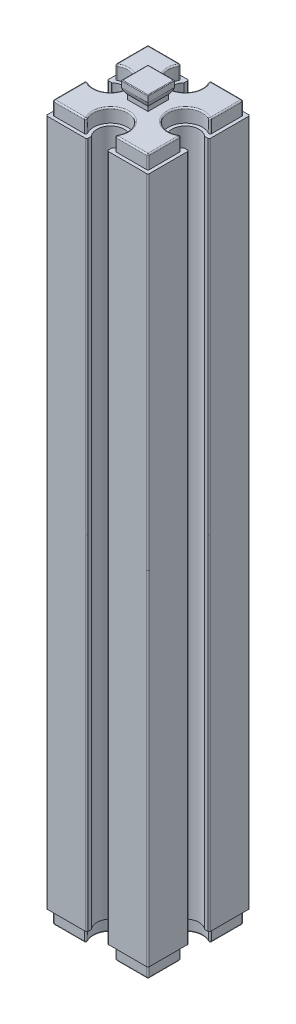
from build123d import *

# Parameters (mm, degrees)
EXTRUDE_1_DEPTH        = 50.5
EXTRUDE_2_DEPTH        = 2
EXTRUDE_3_DEPTH        = 2
FILLET_3_R             = 0.2
CUT_EXTRUDE_1_DEPTH    = 3
FILLET_4_R             = 0.2
FILLET_5_R             = 0.1
FILLET_3_OF_MIRROR_1_R = 0.2
FILLET_4_OF_MIRROR_1_R = 0.2
FILLET_5_OF_MIRROR_1_R = 0.1


with BuildPart() as part:
    # Sketch 1 → Extrude 1 (new body)
    with BuildSketch(Plane(origin=(0, 0, 0), x_dir=(1, 0, 0), z_dir=(0, 1, 0))):
        with BuildLine():
            Line((-7.5, 7.5), (-1.5, 7.5))
            Line((-1.5, 7.5), (-1.5, 6.822875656))
            ThreePointArc((-1.5, 6.822875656), (0, 3.5), (1.5, 6.822875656))
            Line((1.5, 6.822875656), (1.5, 7.5))
            Line((1.5, 7.5), (7.5, 7.5))
            Line((7.5, 7.5), (7.5, 1.5))
            Line((7.5, 1.5), (6.822875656, 1.5))
            ThreePointArc((6.822875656, 1.5), (3.5, 0), (6.822875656, -1.5))
            Line((6.822875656, -1.5), (7.5, -1.5))
            Line((7.5, -1.5), (7.5, -7.5))
            Line((7.5, -7.5), (1.5, -7.5))
            Line((1.5, -7.5), (1.5, -6.822875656))
            ThreePointArc((1.5, -6.822875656), (0, -3.5), (-1.5, -6.822875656))
            Line((-1.5, -6.822875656), (-1.5, -7.5))
            Line((-1.5, -7.5), (-7.5, -7.5))
            Line((-7.5, -7.5), (-7.5, -1.5))
            Line((-7.5, -1.5), (-6.822875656, -1.5))
            ThreePointArc((-6.822875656, -1.5), (-3.5, 0), (-6.822875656, 1.5))
            Line((-6.822875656, 1.5), (-7.5, 1.5))
            Line((-7.5, 1.5), (-7.5, 7.5))
        make_face()
    extrude_1 = extrude(amount=EXTRUDE_1_DEPTH)

    # Sketch 2 → Extrude 2 (add)
    with BuildSketch(Plane(origin=(0, 50.5, 0), x_dir=(1, 0, 0), z_dir=(0, 1, 0))):
        with BuildLine():
            Line((-7, 7), (-7, 2))
            ThreePointArc((-7, 2), (-3, 0), (-7, -2))
            Line((-7, -2), (-7, -7))
            Line((-7, -7), (-2, -7))
            ThreePointArc((-2, -7), (0, -3), (2, -7))
            Line((2, -7), (7, -7))
            Line((7, -7), (7, -2))
            ThreePointArc((7, -2), (3, 0), (7, 2))
            Line((7, 2), (7, 7))
            Line((7, 7), (2, 7))
            ThreePointArc((2, 7), (0, 3), (-2, 7))
            Line((-2, 7), (-7, 7))
        make_face()
    extrude_2 = extrude(amount=EXTRUDE_2_DEPTH)

    # Sketch 3 → Extrude 3 (add, symmetric)
    with BuildSketch(Plane(origin=(0, 0, 0), x_dir=(0, 0, -1), z_dir=(1, 0, 0))):
        with BuildLine():
            Line((-1.5, 52.5), (1.5, 52.5))
            Line((1.5, 52.5), (1.5, 53.177124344))
            ThreePointArc((1.5, 53.177124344), (1.780042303, 53.588161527), (1.95, 54.055590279))
            Line((1.95, 54.055590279), (1.95, 55))
            Line((1.95, 55), (-1.95, 55))
            Line((-1.95, 55), (-1.95, 54.055590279))
            ThreePointArc((-1.95, 54.055590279), (-1.780042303, 53.588161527), (-1.5, 53.177124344))
            Line((-1.5, 53.177124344), (-1.5, 52.5))
        make_face()
    extrude_3 = extrude(amount=EXTRUDE_3_DEPTH, both=True)

    # Fillet 3
    fillet_3_edges = [part.edges().sort_by_distance(p)[0] for p in [
        (-7.5, 25.25, -7.5),
        (-1.5, 25.25, -7.5),
        (1.5, 25.25, -7.5),
        (7.5, 25.25, -7.5),
        (7.5, 25.25, -1.5),
        (7.5, 25.25, 1.5),
        (7.5, 25.25, 7.5),
        (1.5, 25.25, 7.5),
        (-1.5, 25.25, 7.5),
        (-7.5, 25.25, 7.5),
        (-7.5, 25.25, 1.5),
        (-6.822875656, 25.25, -1.5),
        (-7.5, 25.25, -1.5),
    ]]
    fillet(fillet_3_edges, radius=FILLET_3_R)

    # Sketch 4 → Cut-Extrude 1 (cut, symmetric)
    with BuildSketch(Plane.XY):
        with BuildLine():
            Line((1.95, 55), (2, 55))
            Line((2, 55), (2, 52.5))
            Line((2, 52.5), (1.5, 52.5))
            Line((1.5, 52.5), (1.5, 53.177124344))
            ThreePointArc((1.5, 53.177124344), (1.780042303, 53.588161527), (1.95, 54.055590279))
            Line((1.95, 54.055590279), (1.95, 55))
        make_face()
        with BuildLine():
            Line((-1.95, 55), (-1.95, 54.055590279))
            ThreePointArc((-1.95, 54.055590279), (-1.780042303, 53.588161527), (-1.5, 53.177124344))
            Line((-1.5, 53.177124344), (-1.5, 52.5))
            Line((-1.5, 52.5), (-2, 52.5))
            Line((-2, 52.5), (-2, 55))
            Line((-2, 55), (-1.95, 55))
        make_face()
    cut_extrude_1 = extrude(amount=CUT_EXTRUDE_1_DEPTH, both=True, mode=Mode.SUBTRACT)

    # Fillet 4
    fillet_4_edges = [part.edges().sort_by_distance(p)[0] for p in [
        (-2, 51.5, -7),
        (-7, 51.5, -7),
        (-7, 51.5, -2),
        (-7, 51.5, 2),
        (-7, 51.5, 7),
        (-2, 51.5, 7),
        (2, 51.5, 7),
        (7, 51.5, 7),
        (7, 51.5, 2),
        (7, 51.5, -2),
        (7, 51.5, -7),
        (2, 51.5, -7),
        (-4.5, 52.5, -7),
        (-7, 52.5, -4.5),
        (-3, 52.5, 0),
        (-7, 52.5, 4.5),
        (-4.5, 52.5, 7),
        (0, 52.5, 3),
        (4.5, 52.5, 7),
        (7, 52.5, 4.5),
        (3, 52.5, 0),
        (7, 52.5, -4.5),
        (4.5, 52.5, -7),
        (0, 52.5, -3),
    ]]
    fillet(fillet_4_edges, radius=FILLET_4_R)

    # Fillet 5
    fillet_5_edges = [part.edges().sort_by_distance(p)[0] for p in [
        (1.95, 55, 0),
        (0, 55, -1.95),
        (0, 55, 1.95),
        (-1.95, 55, 0),
    ]]
    fillet(fillet_5_edges, radius=FILLET_5_R)


with BuildPart() as mirror_1_1:
    # Mirror 1: Extrude 1, Extrude 2, Extrude 3 across Top Plane
    add(extrude_1.mirror(Plane(origin=(0, 0, 0), x_dir=(1, 0, 0), z_dir=(0, 1, 0))))
    add(extrude_2.mirror(Plane(origin=(0, 0, 0), x_dir=(1, 0, 0), z_dir=(0, 1, 0))))
    add(extrude_3.mirror(Plane(origin=(0, 0, 0), x_dir=(1, 0, 0), z_dir=(0, 1, 0))))

    # Mirror 1 2: Cut-Extrude 1 across Top Plane
    add(cut_extrude_1.mirror(Plane(origin=(0, 0, 0), x_dir=(1, 0, 0), z_dir=(0, 1, 0))), mode=Mode.SUBTRACT)

    # Fillet 3 of Mirror 1
    fillet_3_of_mirror_1_edges = [mirror_1_1.edges().sort_by_distance(p)[0] for p in [
        (-7.5, -25.25, -7.5),
        (-1.5, -25.25, -7.5),
        (1.5, -25.25, -7.5),
        (7.5, -25.25, -7.5),
        (7.5, -25.25, -1.5),
        (7.5, -25.25, 1.5),
        (7.5, -25.25, 7.5),
        (1.5, -25.25, 7.5),
        (-1.5, -25.25, 7.5),
        (-7.5, -25.25, 7.5),
        (-7.5, -25.25, 1.5),
        (-6.822875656, -25.25, -1.5),
        (-7.5, -25.25, -1.5),
    ]]
    fillet(fillet_3_of_mirror_1_edges, radius=FILLET_3_OF_MIRROR_1_R)

    # Fillet 4 of Mirror 1
    fillet_4_of_mirror_1_edges = [mirror_1_1.edges().sort_by_distance(p)[0] for p in [
        (-2, -51.5, -7),
        (-7, -51.5, -7),
        (-7, -51.5, -2),
        (-7, -51.5, 2),
        (-7, -51.5, 7),
        (-2, -51.5, 7),
        (2, -51.5, 7),
        (7, -51.5, 7),
        (7, -51.5, 2),
        (7, -51.5, -2),
        (7, -51.5, -7),
        (2, -51.5, -7),
        (-4.5, -52.5, -7),
        (-7, -52.5, -4.5),
        (-3, -52.5, 0),
        (-7, -52.5, 4.5),
        (-4.5, -52.5, 7),
        (0, -52.5, 3),
        (4.5, -52.5, 7),
        (7, -52.5, 4.5),
        (3, -52.5, 0),
        (7, -52.5, -4.5),
        (4.5, -52.5, -7),
        (0, -52.5, -3),
    ]]
    fillet(fillet_4_of_mirror_1_edges, radius=FILLET_4_OF_MIRROR_1_R)

    # Fillet 5 of Mirror 1
    fillet_5_of_mirror_1_edges = [mirror_1_1.edges().sort_by_distance(p)[0] for p in [
        (1.95, -55, 0),
        (0, -55, -1.95),
        (0, -55, 1.95),
        (-1.95, -55, 0),
    ]]
    fillet(fillet_5_of_mirror_1_edges, radius=FILLET_5_OF_MIRROR_1_R)


with BuildPart() as part_1:
    add(part.part)

    # Mirror 1 united with what the copies tou: union Mirror 1_1
    add(mirror_1_1.part)


solid = part_1.part
